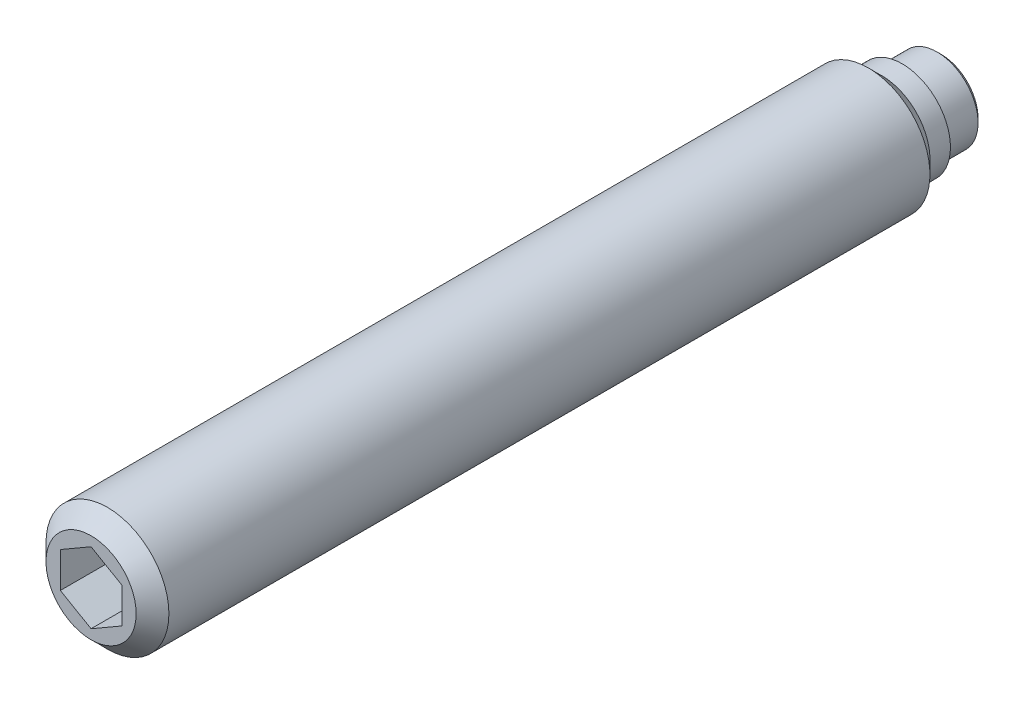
ISO-10303-21;
HEADER;
FILE_DESCRIPTION(('STEP AP214'),'2;1');
FILE_NAME('part.step','',(''),(''),'','','');
FILE_SCHEMA(('AUTOMOTIVE_DESIGN { 1 0 10303 214 1 1 1 1 }'));
ENDSEC;
DATA;
#1=APPLICATION_CONTEXT('core data for automotive mechanical design processes');
#2=APPLICATION_PROTOCOL_DEFINITION('international standard','automotive_design',2000,#1);
#3=PRODUCT_CONTEXT('',#1,'mechanical');
#4=PRODUCT('Part','Part','',(#3));
#5=PRODUCT_RELATED_PRODUCT_CATEGORY('part','',(#4));
#6=PRODUCT_DEFINITION_FORMATION('','',#4);
#7=PRODUCT_DEFINITION_CONTEXT('part definition',#1,'design');
#8=PRODUCT_DEFINITION('design','',#6,#7);
#9=PRODUCT_DEFINITION_SHAPE('','',#8);
#10=(LENGTH_UNIT() NAMED_UNIT(*) SI_UNIT(.MILLI.,.METRE.));
#11=(NAMED_UNIT(*) PLANE_ANGLE_UNIT() SI_UNIT($,.RADIAN.));
#12=(NAMED_UNIT(*) SI_UNIT($,.STERADIAN.) SOLID_ANGLE_UNIT());
#13=UNCERTAINTY_MEASURE_WITH_UNIT(LENGTH_MEASURE(1.E-05),#10,'distance_accuracy_value','');
#14=(GEOMETRIC_REPRESENTATION_CONTEXT(3) GLOBAL_UNCERTAINTY_ASSIGNED_CONTEXT((#13)) GLOBAL_UNIT_ASSIGNED_CONTEXT((#10,
#11,#12)) REPRESENTATION_CONTEXT('',''));
#15=CARTESIAN_POINT('',(0.,0.,0.));
#16=DIRECTION('',(0.,0.,1.));
#17=DIRECTION('',(1.,0.,0.));
#18=AXIS2_PLACEMENT_3D('',#15,#16,#17);
#19=CARTESIAN_POINT('',(0.,0.,1.9));
#20=DIRECTION('',(0.,0.,-1.));
#21=DIRECTION('',(-1.,0.,0.));
#22=AXIS2_PLACEMENT_3D('',#19,#20,#21);
#23=CYLINDRICAL_SURFACE('',#22,3.);
#24=CARTESIAN_POINT('',(0.,0.,3.55));
#25=DIRECTION('',(0.,0.,-1.));
#26=DIRECTION('',(-1.,0.,0.));
#27=AXIS2_PLACEMENT_3D('',#24,#25,#26);
#28=CIRCLE('',#27,3.);
#29=CARTESIAN_POINT('',(-3.,0.,3.55));
#30=VERTEX_POINT('',#29);
#31=EDGE_CURVE('E9',#30,#30,#28,.T.);
#32=ORIENTED_EDGE('',*,*,#31,.F.);
#33=EDGE_LOOP('',(#32));
#34=FACE_BOUND('',#33,.T.);
#35=CARTESIAN_POINT('',(0.,0.,40.7));
#36=DIRECTION('',(0.,0.,1.));
#37=DIRECTION('',(1.,0.,0.));
#38=AXIS2_PLACEMENT_3D('',#35,#36,#37);
#39=CIRCLE('',#38,3.);
#40=CARTESIAN_POINT('',(3.,0.,40.7));
#41=VERTEX_POINT('',#40);
#42=EDGE_CURVE('E123',#41,#41,#39,.T.);
#43=ORIENTED_EDGE('',*,*,#42,.F.);
#44=EDGE_LOOP('',(#43));
#45=FACE_BOUND('',#44,.T.);
#46=ADVANCED_FACE('F14',(#34,#45),#23,.T.);
#47=CARTESIAN_POINT('',(0.,0.,3.55));
#48=DIRECTION('',(0.,0.,1.));
#49=DIRECTION('',(1.,0.,0.));
#50=AXIS2_PLACEMENT_3D('',#47,#48,#49);
#51=CONICAL_SURFACE('',#50,3.,0.785398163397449);
#52=ORIENTED_EDGE('',*,*,#31,.T.);
#53=EDGE_LOOP('',(#52));
#54=FACE_BOUND('',#53,.T.);
#55=CARTESIAN_POINT('',(0.,0.,2.9));
#56=DIRECTION('',(0.,0.,-1.));
#57=DIRECTION('',(-1.,0.,0.));
#58=AXIS2_PLACEMENT_3D('',#55,#56,#57);
#59=CIRCLE('',#58,2.35);
#60=CARTESIAN_POINT('',(-2.35,0.,2.9));
#61=VERTEX_POINT('',#60);
#62=EDGE_CURVE('E21',#61,#61,#59,.T.);
#63=ORIENTED_EDGE('',*,*,#62,.F.);
#64=EDGE_LOOP('',(#63));
#65=FACE_BOUND('',#64,.T.);
#66=ADVANCED_FACE('F143',(#54,#65),#51,.T.);
#67=CARTESIAN_POINT('',(0.,0.,1.9));
#68=DIRECTION('',(0.,0.,-1.));
#69=DIRECTION('',(-1.,0.,0.));
#70=AXIS2_PLACEMENT_3D('',#67,#68,#69);
#71=CYLINDRICAL_SURFACE('',#70,2.35);
#72=ORIENTED_EDGE('',*,*,#62,.T.);
#73=EDGE_LOOP('',(#72));
#74=FACE_BOUND('',#73,.T.);
#75=CARTESIAN_POINT('',(0.,0.,1.9));
#76=DIRECTION('',(0.,0.,-1.));
#77=DIRECTION('',(-1.,0.,0.));
#78=AXIS2_PLACEMENT_3D('',#75,#76,#77);
#79=CIRCLE('',#78,2.35);
#80=CARTESIAN_POINT('',(-2.35,0.,1.9));
#81=VERTEX_POINT('',#80);
#82=EDGE_CURVE('E135',#81,#81,#79,.T.);
#83=ORIENTED_EDGE('',*,*,#82,.F.);
#84=EDGE_LOOP('',(#83));
#85=FACE_BOUND('',#84,.T.);
#86=ADVANCED_FACE('F140',(#74,#85),#71,.T.);
#87=CARTESIAN_POINT('',(0.,2.35,1.9));
#88=DIRECTION('',(0.,0.,1.));
#89=DIRECTION('',(1.,0.,0.));
#90=AXIS2_PLACEMENT_3D('',#87,#88,#89);
#91=PLANE('',#90);
#92=ORIENTED_EDGE('',*,*,#82,.T.);
#93=EDGE_LOOP('',(#92));
#94=FACE_BOUND('',#93,.T.);
#95=CARTESIAN_POINT('',(0.,0.,1.9));
#96=DIRECTION('',(0.,0.,-1.));
#97=DIRECTION('',(-1.,0.,0.));
#98=AXIS2_PLACEMENT_3D('',#95,#96,#97);
#99=CIRCLE('',#98,2.);
#100=CARTESIAN_POINT('',(-2.,0.,1.9));
#101=VERTEX_POINT('',#100);
#102=EDGE_CURVE('E132',#101,#101,#99,.T.);
#103=ORIENTED_EDGE('',*,*,#102,.F.);
#104=EDGE_LOOP('',(#103));
#105=FACE_BOUND('',#104,.T.);
#106=ADVANCED_FACE('F151',(#94,#105),#91,.F.);
#107=CARTESIAN_POINT('',(0.,0.,0.));
#108=DIRECTION('',(0.,0.,-1.));
#109=DIRECTION('',(-1.,0.,0.));
#110=AXIS2_PLACEMENT_3D('',#107,#108,#109);
#111=CYLINDRICAL_SURFACE('',#110,2.);
#112=CARTESIAN_POINT('',(0.,0.,0.2));
#113=DIRECTION('',(0.,0.,-1.));
#114=DIRECTION('',(-1.,0.,0.));
#115=AXIS2_PLACEMENT_3D('',#112,#113,#114);
#116=CIRCLE('',#115,2.);
#117=CARTESIAN_POINT('',(-2.,0.,0.2));
#118=VERTEX_POINT('',#117);
#119=EDGE_CURVE('E129',#118,#118,#116,.T.);
#120=ORIENTED_EDGE('',*,*,#119,.F.);
#121=EDGE_LOOP('',(#120));
#122=FACE_BOUND('',#121,.T.);
#123=ORIENTED_EDGE('',*,*,#102,.T.);
#124=EDGE_LOOP('',(#123));
#125=FACE_BOUND('',#124,.T.);
#126=ADVANCED_FACE('F157',(#122,#125),#111,.T.);
#127=CARTESIAN_POINT('',(0.,0.,0.2));
#128=DIRECTION('',(0.,0.,1.));
#129=DIRECTION('',(1.,0.,0.));
#130=AXIS2_PLACEMENT_3D('',#127,#128,#129);
#131=CONICAL_SURFACE('',#130,2.,0.785398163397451);
#132=CARTESIAN_POINT('',(0.,0.,0.));
#133=DIRECTION('',(0.,0.,-1.));
#134=DIRECTION('',(-1.,0.,0.));
#135=AXIS2_PLACEMENT_3D('',#132,#133,#134);
#136=CIRCLE('',#135,1.8);
#137=CARTESIAN_POINT('',(-1.8,0.,0.));
#138=VERTEX_POINT('',#137);
#139=EDGE_CURVE('E126',#138,#138,#136,.T.);
#140=ORIENTED_EDGE('',*,*,#139,.F.);
#141=EDGE_LOOP('',(#140));
#142=FACE_BOUND('',#141,.T.);
#143=ORIENTED_EDGE('',*,*,#119,.T.);
#144=EDGE_LOOP('',(#143));
#145=FACE_BOUND('',#144,.T.);
#146=ADVANCED_FACE('F161',(#142,#145),#131,.T.);
#147=CARTESIAN_POINT('',(0.,1.8,0.));
#148=DIRECTION('',(0.,0.,1.));
#149=DIRECTION('',(1.,0.,0.));
#150=AXIS2_PLACEMENT_3D('',#147,#148,#149);
#151=PLANE('',#150);
#152=ORIENTED_EDGE('',*,*,#139,.T.);
#153=EDGE_LOOP('',(#152));
#154=FACE_BOUND('',#153,.T.);
#155=ADVANCED_FACE('F165',(#154),#151,.F.);
#156=CARTESIAN_POINT('',(0.,0.,41.5));
#157=DIRECTION('',(0.,0.,-1.));
#158=DIRECTION('',(-1.,0.,0.));
#159=AXIS2_PLACEMENT_3D('',#156,#157,#158);
#160=CONICAL_SURFACE('',#159,2.2,0.785398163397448);
#161=ORIENTED_EDGE('',*,*,#42,.T.);
#162=EDGE_LOOP('',(#161));
#163=FACE_BOUND('',#162,.T.);
#164=CARTESIAN_POINT('',(0.,0.,41.5));
#165=DIRECTION('',(0.,0.,1.));
#166=DIRECTION('',(1.,0.,0.));
#167=AXIS2_PLACEMENT_3D('',#164,#165,#166);
#168=CIRCLE('',#167,2.2);
#169=CARTESIAN_POINT('',(2.2,0.,41.5));
#170=VERTEX_POINT('',#169);
#171=EDGE_CURVE('E115',#170,#170,#168,.T.);
#172=ORIENTED_EDGE('',*,*,#171,.F.);
#173=EDGE_LOOP('',(#172));
#174=FACE_BOUND('',#173,.T.);
#175=ADVANCED_FACE('F169',(#163,#174),#160,.T.);
#176=CARTESIAN_POINT('',(0.,0.,41.5));
#177=DIRECTION('',(0.,0.,1.));
#178=DIRECTION('',(1.,0.,0.));
#179=AXIS2_PLACEMENT_3D('',#176,#177,#178);
#180=PLANE('',#179);
#181=DIRECTION('',(0.866025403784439,-0.5,0.));
#182=VECTOR('',#181,1.);
#183=CARTESIAN_POINT('',(-1.5,-0.866025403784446,41.5));
#184=LINE('',#183,#182);
#185=CARTESIAN_POINT('',(-1.5,-0.866025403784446,41.5));
#186=VERTEX_POINT('',#185);
#187=CARTESIAN_POINT('',(0.,-1.73205080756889,41.5));
#188=VERTEX_POINT('',#187);
#189=EDGE_CURVE('E28',#186,#188,#184,.T.);
#190=ORIENTED_EDGE('',*,*,#189,.F.);
#191=DIRECTION('',(0.,-1.,0.));
#192=VECTOR('',#191,1.);
#193=CARTESIAN_POINT('',(-1.5,0.866025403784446,41.5));
#194=LINE('',#193,#192);
#195=CARTESIAN_POINT('',(-1.5,0.866025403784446,41.5));
#196=VERTEX_POINT('',#195);
#197=EDGE_CURVE('E111',#196,#186,#194,.T.);
#198=ORIENTED_EDGE('',*,*,#197,.F.);
#199=DIRECTION('',(-0.866025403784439,-0.5,0.));
#200=VECTOR('',#199,1.);
#201=CARTESIAN_POINT('',(0.,1.73205080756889,41.5));
#202=LINE('',#201,#200);
#203=CARTESIAN_POINT('',(0.,1.73205080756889,41.5));
#204=VERTEX_POINT('',#203);
#205=EDGE_CURVE('E109',#204,#196,#202,.T.);
#206=ORIENTED_EDGE('',*,*,#205,.F.);
#207=DIRECTION('',(-0.866025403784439,0.5,0.));
#208=VECTOR('',#207,1.);
#209=CARTESIAN_POINT('',(1.5,0.866025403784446,41.5));
#210=LINE('',#209,#208);
#211=CARTESIAN_POINT('',(1.5,0.866025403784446,41.5));
#212=VERTEX_POINT('',#211);
#213=EDGE_CURVE('E76',#212,#204,#210,.T.);
#214=ORIENTED_EDGE('',*,*,#213,.F.);
#215=DIRECTION('',(0.,1.,0.));
#216=VECTOR('',#215,1.);
#217=CARTESIAN_POINT('',(1.5,-0.866025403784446,41.5));
#218=LINE('',#217,#216);
#219=CARTESIAN_POINT('',(1.5,-0.866025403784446,41.5));
#220=VERTEX_POINT('',#219);
#221=EDGE_CURVE('E105',#220,#212,#218,.T.);
#222=ORIENTED_EDGE('',*,*,#221,.F.);
#223=DIRECTION('',(0.866025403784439,0.5,0.));
#224=VECTOR('',#223,1.);
#225=CARTESIAN_POINT('',(0.,-1.73205080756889,41.5));
#226=LINE('',#225,#224);
#227=EDGE_CURVE('E102',#188,#220,#226,.T.);
#228=ORIENTED_EDGE('',*,*,#227,.F.);
#229=EDGE_LOOP('',(#190,#198,#206,#214,#222,#228));
#230=FACE_BOUND('',#229,.T.);
#231=ORIENTED_EDGE('',*,*,#171,.T.);
#232=EDGE_LOOP('',(#231));
#233=FACE_BOUND('',#232,.T.);
#234=ADVANCED_FACE('F173',(#230,#233),#180,.T.);
#235=CARTESIAN_POINT('',(-1.5,-0.866025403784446,38.));
#236=DIRECTION('',(-0.5,-0.866025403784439,0.));
#237=DIRECTION('',(0.866025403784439,-0.5,0.));
#238=AXIS2_PLACEMENT_3D('',#235,#236,#237);
#239=PLANE('',#238);
#240=ORIENTED_EDGE('',*,*,#189,.T.);
#241=DIRECTION('',(0.,0.,1.));
#242=VECTOR('',#241,1.);
#243=CARTESIAN_POINT('',(0.,-1.73205080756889,38.));
#244=LINE('',#243,#242);
#245=CARTESIAN_POINT('',(0.,-1.73205080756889,38.));
#246=VERTEX_POINT('',#245);
#247=EDGE_CURVE('E58',#246,#188,#244,.T.);
#248=ORIENTED_EDGE('',*,*,#247,.F.);
#249=DIRECTION('',(0.866025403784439,-0.5,0.));
#250=VECTOR('',#249,1.);
#251=CARTESIAN_POINT('',(-1.5,-0.866025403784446,38.));
#252=LINE('',#251,#250);
#253=CARTESIAN_POINT('',(-1.5,-0.866025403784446,38.));
#254=VERTEX_POINT('',#253);
#255=EDGE_CURVE('E113',#254,#246,#252,.T.);
#256=ORIENTED_EDGE('',*,*,#255,.F.);
#257=DIRECTION('',(0.,0.,1.));
#258=VECTOR('',#257,1.);
#259=CARTESIAN_POINT('',(-1.5,-0.866025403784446,38.));
#260=LINE('',#259,#258);
#261=EDGE_CURVE('E36',#254,#186,#260,.T.);
#262=ORIENTED_EDGE('',*,*,#261,.T.);
#263=EDGE_LOOP('',(#240,#248,#256,#262));
#264=FACE_BOUND('',#263,.T.);
#265=ADVANCED_FACE('F177',(#264),#239,.F.);
#266=CARTESIAN_POINT('',(-1.5,0.866025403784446,38.));
#267=DIRECTION('',(-1.,0.,0.));
#268=DIRECTION('',(0.,0.,1.));
#269=AXIS2_PLACEMENT_3D('',#266,#267,#268);
#270=PLANE('',#269);
#271=ORIENTED_EDGE('',*,*,#197,.T.);
#272=ORIENTED_EDGE('',*,*,#261,.F.);
#273=DIRECTION('',(0.,-1.,0.));
#274=VECTOR('',#273,1.);
#275=CARTESIAN_POINT('',(-1.5,0.866025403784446,38.));
#276=LINE('',#275,#274);
#277=CARTESIAN_POINT('',(-1.5,0.866025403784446,38.));
#278=VERTEX_POINT('',#277);
#279=EDGE_CURVE('E88',#278,#254,#276,.T.);
#280=ORIENTED_EDGE('',*,*,#279,.F.);
#281=DIRECTION('',(0.,0.,1.));
#282=VECTOR('',#281,1.);
#283=CARTESIAN_POINT('',(-1.5,0.866025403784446,38.));
#284=LINE('',#283,#282);
#285=EDGE_CURVE('E80',#278,#196,#284,.T.);
#286=ORIENTED_EDGE('',*,*,#285,.T.);
#287=EDGE_LOOP('',(#271,#272,#280,#286));
#288=FACE_BOUND('',#287,.T.);
#289=ADVANCED_FACE('F181',(#288),#270,.F.);
#290=CARTESIAN_POINT('',(0.,1.73205080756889,38.));
#291=DIRECTION('',(-0.5,0.866025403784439,0.));
#292=DIRECTION('',(-0.866025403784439,-0.5,0.));
#293=AXIS2_PLACEMENT_3D('',#290,#291,#292);
#294=PLANE('',#293);
#295=ORIENTED_EDGE('',*,*,#205,.T.);
#296=ORIENTED_EDGE('',*,*,#285,.F.);
#297=DIRECTION('',(-0.866025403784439,-0.5,0.));
#298=VECTOR('',#297,1.);
#299=CARTESIAN_POINT('',(0.,1.73205080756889,38.));
#300=LINE('',#299,#298);
#301=CARTESIAN_POINT('',(0.,1.73205080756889,38.));
#302=VERTEX_POINT('',#301);
#303=EDGE_CURVE('E84',#302,#278,#300,.T.);
#304=ORIENTED_EDGE('',*,*,#303,.F.);
#305=DIRECTION('',(0.,0.,1.));
#306=VECTOR('',#305,1.);
#307=CARTESIAN_POINT('',(0.,1.73205080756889,38.));
#308=LINE('',#307,#306);
#309=EDGE_CURVE('E69',#302,#204,#308,.T.);
#310=ORIENTED_EDGE('',*,*,#309,.T.);
#311=EDGE_LOOP('',(#295,#296,#304,#310));
#312=FACE_BOUND('',#311,.T.);
#313=ADVANCED_FACE('F85',(#312),#294,.F.);
#314=CARTESIAN_POINT('',(1.5,0.866025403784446,38.));
#315=DIRECTION('',(0.5,0.866025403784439,0.));
#316=DIRECTION('',(-0.866025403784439,0.5,0.));
#317=AXIS2_PLACEMENT_3D('',#314,#315,#316);
#318=PLANE('',#317);
#319=ORIENTED_EDGE('',*,*,#213,.T.);
#320=ORIENTED_EDGE('',*,*,#309,.F.);
#321=DIRECTION('',(-0.866025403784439,0.5,0.));
#322=VECTOR('',#321,1.);
#323=CARTESIAN_POINT('',(1.5,0.866025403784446,38.));
#324=LINE('',#323,#322);
#325=CARTESIAN_POINT('',(1.5,0.866025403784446,38.));
#326=VERTEX_POINT('',#325);
#327=EDGE_CURVE('E73',#326,#302,#324,.T.);
#328=ORIENTED_EDGE('',*,*,#327,.F.);
#329=DIRECTION('',(0.,0.,1.));
#330=VECTOR('',#329,1.);
#331=CARTESIAN_POINT('',(1.5,0.866025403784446,38.));
#332=LINE('',#331,#330);
#333=EDGE_CURVE('E81',#326,#212,#332,.T.);
#334=ORIENTED_EDGE('',*,*,#333,.T.);
#335=EDGE_LOOP('',(#319,#320,#328,#334));
#336=FACE_BOUND('',#335,.T.);
#337=ADVANCED_FACE('F71',(#336),#318,.F.);
#338=CARTESIAN_POINT('',(1.5,-0.866025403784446,38.));
#339=DIRECTION('',(1.,0.,0.));
#340=DIRECTION('',(0.,0.,-1.));
#341=AXIS2_PLACEMENT_3D('',#338,#339,#340);
#342=PLANE('',#341);
#343=ORIENTED_EDGE('',*,*,#221,.T.);
#344=ORIENTED_EDGE('',*,*,#333,.F.);
#345=DIRECTION('',(0.,1.,0.));
#346=VECTOR('',#345,1.);
#347=CARTESIAN_POINT('',(1.5,-0.866025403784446,38.));
#348=LINE('',#347,#346);
#349=CARTESIAN_POINT('',(1.5,-0.866025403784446,38.));
#350=VERTEX_POINT('',#349);
#351=EDGE_CURVE('E94',#350,#326,#348,.T.);
#352=ORIENTED_EDGE('',*,*,#351,.F.);
#353=DIRECTION('',(0.,0.,1.));
#354=VECTOR('',#353,1.);
#355=CARTESIAN_POINT('',(1.5,-0.866025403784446,38.));
#356=LINE('',#355,#354);
#357=EDGE_CURVE('E118',#350,#220,#356,.T.);
#358=ORIENTED_EDGE('',*,*,#357,.T.);
#359=EDGE_LOOP('',(#343,#344,#352,#358));
#360=FACE_BOUND('',#359,.T.);
#361=ADVANCED_FACE('F185',(#360),#342,.F.);
#362=CARTESIAN_POINT('',(0.,-1.73205080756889,38.));
#363=DIRECTION('',(0.5,-0.866025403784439,0.));
#364=DIRECTION('',(0.866025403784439,0.5,0.));
#365=AXIS2_PLACEMENT_3D('',#362,#363,#364);
#366=PLANE('',#365);
#367=ORIENTED_EDGE('',*,*,#227,.T.);
#368=ORIENTED_EDGE('',*,*,#357,.F.);
#369=DIRECTION('',(0.866025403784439,0.5,0.));
#370=VECTOR('',#369,1.);
#371=CARTESIAN_POINT('',(0.,-1.73205080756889,38.));
#372=LINE('',#371,#370);
#373=EDGE_CURVE('E96',#246,#350,#372,.T.);
#374=ORIENTED_EDGE('',*,*,#373,.F.);
#375=ORIENTED_EDGE('',*,*,#247,.T.);
#376=EDGE_LOOP('',(#367,#368,#374,#375));
#377=FACE_BOUND('',#376,.T.);
#378=ADVANCED_FACE('F182',(#377),#366,.F.);
#379=CARTESIAN_POINT('',(0.,0.,38.));
#380=DIRECTION('',(0.,0.,1.));
#381=DIRECTION('',(1.,0.,0.));
#382=AXIS2_PLACEMENT_3D('',#379,#380,#381);
#383=PLANE('',#382);
#384=ORIENTED_EDGE('',*,*,#255,.T.);
#385=ORIENTED_EDGE('',*,*,#373,.T.);
#386=ORIENTED_EDGE('',*,*,#351,.T.);
#387=ORIENTED_EDGE('',*,*,#327,.T.);
#388=ORIENTED_EDGE('',*,*,#303,.T.);
#389=ORIENTED_EDGE('',*,*,#279,.T.);
#390=EDGE_LOOP('',(#384,#385,#386,#387,#388,#389));
#391=FACE_BOUND('',#390,.T.);
#392=ADVANCED_FACE('F91',(#391),#383,.T.);
#393=CLOSED_SHELL('',(#46,#66,#86,#106,#126,#146,#155,#175,#234,#265,#289,#313,#337,#361,#378,#392));
#394=MANIFOLD_SOLID_BREP('B1',#393);
#395=ADVANCED_BREP_SHAPE_REPRESENTATION('',(#18,#394),#14);
#396=SHAPE_DEFINITION_REPRESENTATION(#9,#395);
ENDSEC;
END-ISO-10303-21;
